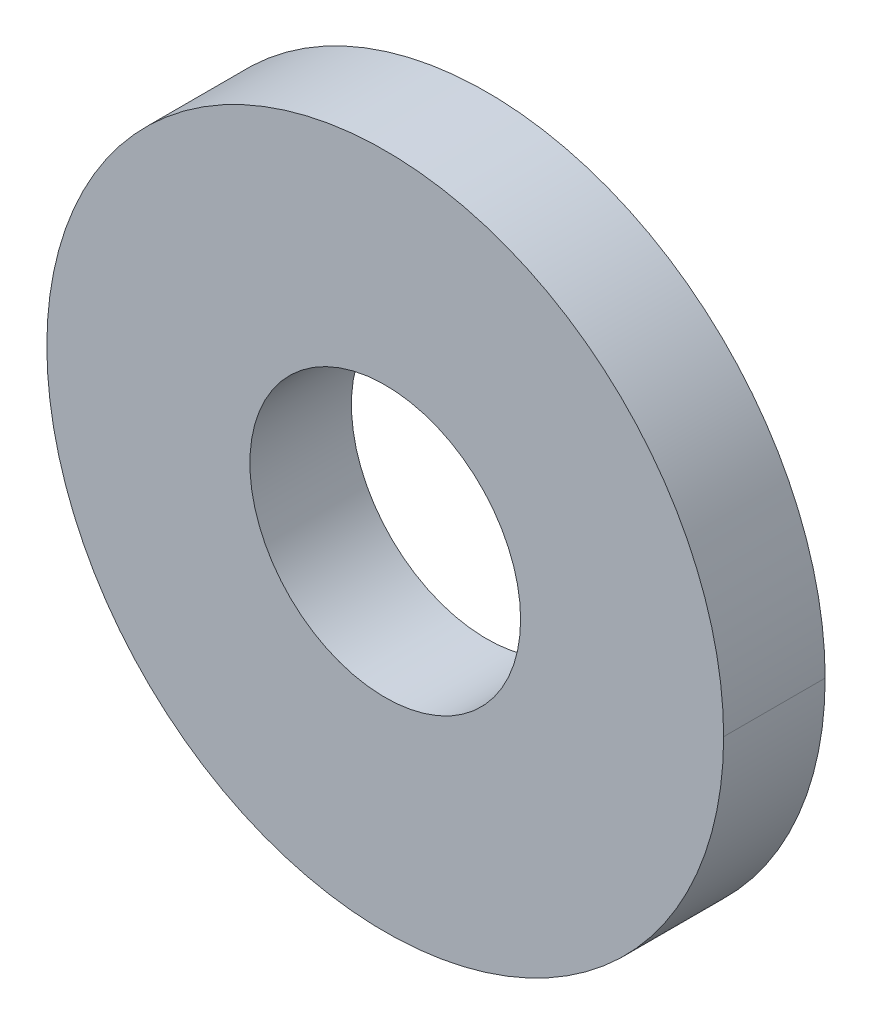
ISO-10303-21;
HEADER;
FILE_DESCRIPTION(('STEP AP214'),'2;1');
FILE_NAME('part.step','',(''),(''),'','','');
FILE_SCHEMA(('AUTOMOTIVE_DESIGN { 1 0 10303 214 1 1 1 1 }'));
ENDSEC;
DATA;
#1=APPLICATION_CONTEXT('core data for automotive mechanical design processes');
#2=APPLICATION_PROTOCOL_DEFINITION('international standard','automotive_design',2000,#1);
#3=PRODUCT_CONTEXT('',#1,'mechanical');
#4=PRODUCT('Part','Part','',(#3));
#5=PRODUCT_RELATED_PRODUCT_CATEGORY('part','',(#4));
#6=PRODUCT_DEFINITION_FORMATION('','',#4);
#7=PRODUCT_DEFINITION_CONTEXT('part definition',#1,'design');
#8=PRODUCT_DEFINITION('design','',#6,#7);
#9=PRODUCT_DEFINITION_SHAPE('','',#8);
#10=(LENGTH_UNIT() NAMED_UNIT(*) SI_UNIT(.MILLI.,.METRE.));
#11=(NAMED_UNIT(*) PLANE_ANGLE_UNIT() SI_UNIT($,.RADIAN.));
#12=(NAMED_UNIT(*) SI_UNIT($,.STERADIAN.) SOLID_ANGLE_UNIT());
#13=UNCERTAINTY_MEASURE_WITH_UNIT(LENGTH_MEASURE(1.E-05),#10,'distance_accuracy_value','');
#14=(GEOMETRIC_REPRESENTATION_CONTEXT(3) GLOBAL_UNCERTAINTY_ASSIGNED_CONTEXT((#13)) GLOBAL_UNIT_ASSIGNED_CONTEXT((#10,
#11,#12)) REPRESENTATION_CONTEXT('',''));
#15=CARTESIAN_POINT('',(0.,0.,0.));
#16=DIRECTION('',(0.,0.,1.));
#17=DIRECTION('',(1.,0.,0.));
#18=AXIS2_PLACEMENT_3D('',#15,#16,#17);
#19=CARTESIAN_POINT('',(8.93120842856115,26.4578481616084,3.));
#20=DIRECTION('',(0.,0.,-1.));
#21=DIRECTION('',(-1.,0.,0.));
#22=AXIS2_PLACEMENT_3D('',#19,#20,#21);
#23=CYLINDRICAL_SURFACE('',#22,5.);
#24=DIRECTION('',(0.,0.,-1.));
#25=VECTOR('',#24,1.);
#26=CARTESIAN_POINT('',(13.9312084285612,26.4578481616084,3.));
#27=LINE('',#26,#25);
#28=CARTESIAN_POINT('',(13.9312084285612,26.4578481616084,1.5));
#29=VERTEX_POINT('',#28);
#30=CARTESIAN_POINT('',(13.9312084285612,26.4578481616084,0.));
#31=VERTEX_POINT('',#30);
#32=EDGE_CURVE('E68',#29,#31,#27,.T.);
#33=ORIENTED_EDGE('',*,*,#32,.F.);
#34=CARTESIAN_POINT('',(8.93120842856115,26.4578481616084,1.5));
#35=DIRECTION('',(0.,0.,1.));
#36=DIRECTION('',(1.,0.,0.));
#37=AXIS2_PLACEMENT_3D('',#34,#35,#36);
#38=CIRCLE('',#37,5.);
#39=CARTESIAN_POINT('',(3.93120842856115,26.4578481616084,1.5));
#40=VERTEX_POINT('',#39);
#41=EDGE_CURVE('E47',#29,#40,#38,.F.);
#42=ORIENTED_EDGE('',*,*,#41,.T.);
#43=DIRECTION('',(0.,0.,-1.));
#44=VECTOR('',#43,1.);
#45=CARTESIAN_POINT('',(3.93120842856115,26.4578481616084,3.));
#46=LINE('',#45,#44);
#47=CARTESIAN_POINT('',(3.93120842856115,26.4578481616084,0.));
#48=VERTEX_POINT('',#47);
#49=EDGE_CURVE('E11',#48,#40,#46,.F.);
#50=ORIENTED_EDGE('',*,*,#49,.F.);
#51=CARTESIAN_POINT('',(8.93120842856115,26.4578481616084,0.));
#52=DIRECTION('',(0.,0.,-1.));
#53=DIRECTION('',(-1.,0.,0.));
#54=AXIS2_PLACEMENT_3D('',#51,#52,#53);
#55=CIRCLE('',#54,5.);
#56=EDGE_CURVE('E55',#48,#31,#55,.F.);
#57=ORIENTED_EDGE('',*,*,#56,.T.);
#58=EDGE_LOOP('',(#33,#42,#50,#57));
#59=FACE_BOUND('',#58,.T.);
#60=ADVANCED_FACE('F31',(#59),#23,.T.);
#61=CARTESIAN_POINT('',(8.93120842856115,26.4578481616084,3.));
#62=DIRECTION('',(0.,0.,-1.));
#63=DIRECTION('',(-1.,0.,0.));
#64=AXIS2_PLACEMENT_3D('',#61,#62,#63);
#65=CYLINDRICAL_SURFACE('',#64,5.);
#66=ORIENTED_EDGE('',*,*,#49,.T.);
#67=CARTESIAN_POINT('',(8.93120842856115,26.4578481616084,1.5));
#68=DIRECTION('',(0.,0.,1.));
#69=DIRECTION('',(1.,0.,0.));
#70=AXIS2_PLACEMENT_3D('',#67,#68,#69);
#71=CIRCLE('',#70,5.);
#72=EDGE_CURVE('E60',#40,#29,#71,.F.);
#73=ORIENTED_EDGE('',*,*,#72,.T.);
#74=ORIENTED_EDGE('',*,*,#32,.T.);
#75=CARTESIAN_POINT('',(8.93120842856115,26.4578481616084,0.));
#76=DIRECTION('',(0.,0.,-1.));
#77=DIRECTION('',(-1.,0.,0.));
#78=AXIS2_PLACEMENT_3D('',#75,#76,#77);
#79=CIRCLE('',#78,5.);
#80=EDGE_CURVE('E40',#31,#48,#79,.F.);
#81=ORIENTED_EDGE('',*,*,#80,.T.);
#82=EDGE_LOOP('',(#66,#73,#74,#81));
#83=FACE_BOUND('',#82,.T.);
#84=ADVANCED_FACE('F71',(#83),#65,.T.);
#85=CARTESIAN_POINT('',(8.93120842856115,26.4578481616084,0.));
#86=DIRECTION('',(0.,0.,1.));
#87=DIRECTION('',(1.,0.,0.));
#88=AXIS2_PLACEMENT_3D('',#85,#86,#87);
#89=CYLINDRICAL_SURFACE('',#88,2.);
#90=CARTESIAN_POINT('',(8.93120842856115,26.4578481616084,0.));
#91=DIRECTION('',(0.,0.,1.));
#92=DIRECTION('',(1.,0.,0.));
#93=AXIS2_PLACEMENT_3D('',#90,#91,#92);
#94=CIRCLE('',#93,2.);
#95=CARTESIAN_POINT('',(10.9312084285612,26.4578481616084,0.));
#96=VERTEX_POINT('',#95);
#97=EDGE_CURVE('E69',#96,#96,#94,.T.);
#98=ORIENTED_EDGE('',*,*,#97,.F.);
#99=EDGE_LOOP('',(#98));
#100=FACE_BOUND('',#99,.T.);
#101=CARTESIAN_POINT('',(8.93120842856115,26.4578481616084,1.5));
#102=DIRECTION('',(0.,0.,1.));
#103=DIRECTION('',(1.,0.,0.));
#104=AXIS2_PLACEMENT_3D('',#101,#102,#103);
#105=CIRCLE('',#104,2.);
#106=CARTESIAN_POINT('',(10.9312084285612,26.4578481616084,1.5));
#107=VERTEX_POINT('',#106);
#108=EDGE_CURVE('E35',#107,#107,#105,.F.);
#109=ORIENTED_EDGE('',*,*,#108,.F.);
#110=EDGE_LOOP('',(#109));
#111=FACE_BOUND('',#110,.T.);
#112=ADVANCED_FACE('F79',(#100,#111),#89,.F.);
#113=CARTESIAN_POINT('',(8.93120842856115,26.4578481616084,0.));
#114=DIRECTION('',(0.,0.,1.));
#115=DIRECTION('',(1.,0.,0.));
#116=AXIS2_PLACEMENT_3D('',#113,#114,#115);
#117=PLANE('',#116);
#118=ORIENTED_EDGE('',*,*,#97,.T.);
#119=EDGE_LOOP('',(#118));
#120=FACE_BOUND('',#119,.T.);
#121=ORIENTED_EDGE('',*,*,#80,.F.);
#122=ORIENTED_EDGE('',*,*,#56,.F.);
#123=EDGE_LOOP('',(#121,#122));
#124=FACE_BOUND('',#123,.T.);
#125=ADVANCED_FACE('F33',(#120,#124),#117,.F.);
#126=CARTESIAN_POINT('',(13.9312084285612,31.4578481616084,1.5));
#127=DIRECTION('',(0.,0.,1.));
#128=DIRECTION('',(1.,0.,0.));
#129=AXIS2_PLACEMENT_3D('',#126,#127,#128);
#130=PLANE('',#129);
#131=ORIENTED_EDGE('',*,*,#72,.F.);
#132=ORIENTED_EDGE('',*,*,#41,.F.);
#133=EDGE_LOOP('',(#131,#132));
#134=FACE_BOUND('',#133,.T.);
#135=ORIENTED_EDGE('',*,*,#108,.T.);
#136=EDGE_LOOP('',(#135));
#137=FACE_BOUND('',#136,.T.);
#138=ADVANCED_FACE('F61',(#134,#137),#130,.T.);
#139=CLOSED_SHELL('',(#60,#84,#112,#125,#138));
#140=MANIFOLD_SOLID_BREP('B2',#139);
#141=ADVANCED_BREP_SHAPE_REPRESENTATION('',(#18,#140),#14);
#142=SHAPE_DEFINITION_REPRESENTATION(#9,#141);
ENDSEC;
END-ISO-10303-21;
